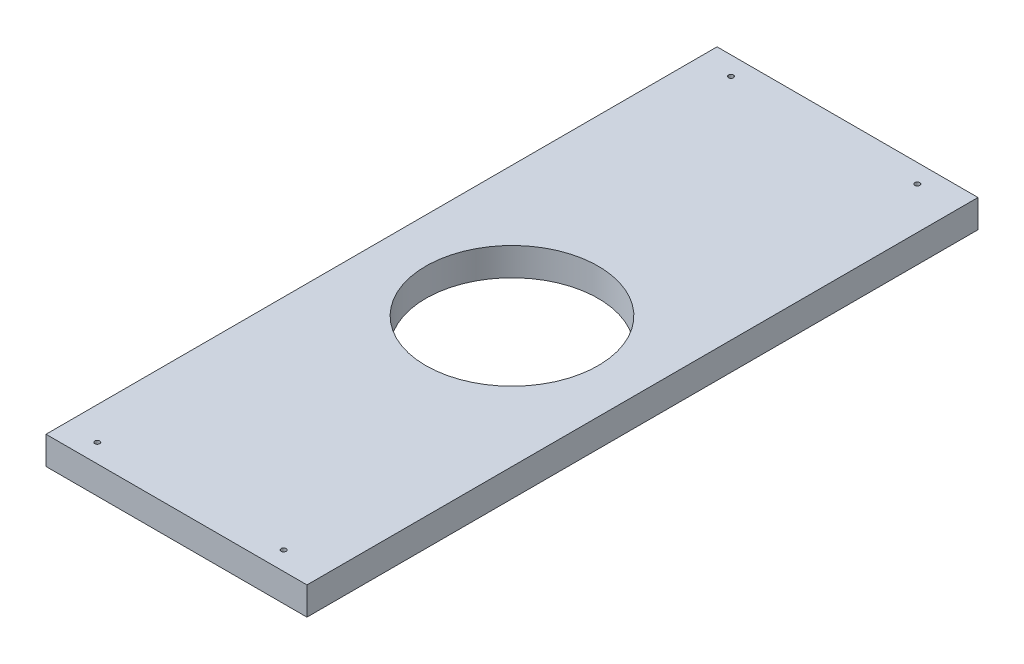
from build123d import *

# Parameters (mm, degrees)
SKETCH1_W               = 355.6
SKETCH1_H               = 914.4
BOSS_EXTRUDE1_DEPTH     = 38.1
SKETCH2_R               = 117.475
CUT_EXTRUDE1_DEPTH      = 493.032813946
F_1_4_CLEARANCE_HOLE1_D = 6.7564


with BuildPart() as part:
    # Sketch1 → Boss-Extrude1 (new body)
    with BuildSketch(Plane(origin=(0, 0, 0), x_dir=(1, 0, 0), z_dir=(0, 1, 0))):
        Rectangle(SKETCH1_W, SKETCH1_H)
    extrude(amount=-BOSS_EXTRUDE1_DEPTH)

    # Sketch2 → Cut-Extrude1 (cut, through all)
    with BuildSketch(Plane(origin=(0, 0, 0), x_dir=(1, 0, 0), z_dir=(0, 1, 0))):
        with Locations(Location((0, 0, 0), (0, 0, 270))):
            Circle(SKETCH2_R)
    extrude(amount=-CUT_EXTRUDE1_DEPTH, mode=Mode.SUBTRACT)

    # 1_4 Clearance Hole1 (through all)
    with Locations(Plane(origin=(0, 0, 0), x_dir=(1, 0, 0), z_dir=(0, 1, 0))):
        with Locations((-133.35, -431.8), (120.65, -431.8), (-133.35, 431.8), (120.65, 431.8)):
            Hole(F_1_4_CLEARANCE_HOLE1_D / 2)


solid = part.part
